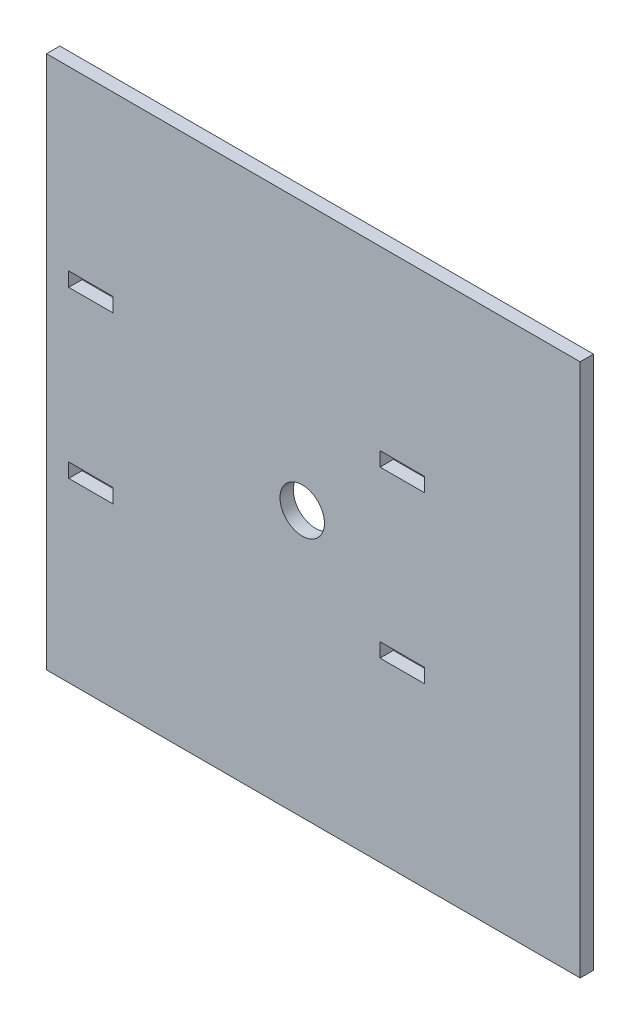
from build123d import *

# Parameters (mm, degrees)
ESQUISSE1_W             = 120
ESQUISSE1_H             = 120
ESQUISSE1_W_2           = 10
ESQUISSE1_H_2           = 3.2
BOSS_EXTRU_1_DEPTH      = 3
ESQUISSE2_R             = 5
ENL_V_MAT_EXTRU_1_DEPTH = 10


with BuildPart() as part:
    # Esquisse1 → Boss.-Extru.1 (new body)
    with BuildSketch(Plane.XY):
        with Locations((31.59937346, 0)):
            Rectangle(ESQUISSE1_W, ESQUISSE1_H)
        with Locations((51.59937346, 18.6)):
            Rectangle(ESQUISSE1_W_2, ESQUISSE1_H_2, mode=Mode.SUBTRACT)
        with Locations((-18.40062654, 18.6)):
            Rectangle(ESQUISSE1_W_2, ESQUISSE1_H_2, mode=Mode.SUBTRACT)
        with Locations((51.59937346, -18.6)):
            Rectangle(ESQUISSE1_W_2, ESQUISSE1_H_2, mode=Mode.SUBTRACT)
        with Locations((-18.40062654, -18.6)):
            Rectangle(ESQUISSE1_W_2, ESQUISSE1_H_2, mode=Mode.SUBTRACT)
    extrude(amount=BOSS_EXTRU_1_DEPTH)

    # Esquisse2 → Enl_v. mat.-Extru.1 (cut)
    with BuildSketch(Plane(origin=(0, 0, 0), x_dir=(-1, 0, 0), z_dir=(0, 0, -1))):
        with Locations((-29.09937346, -0.2)):
            Circle(ESQUISSE2_R)
    extrude(amount=-ENL_V_MAT_EXTRU_1_DEPTH, mode=Mode.SUBTRACT)


solid = part.part
